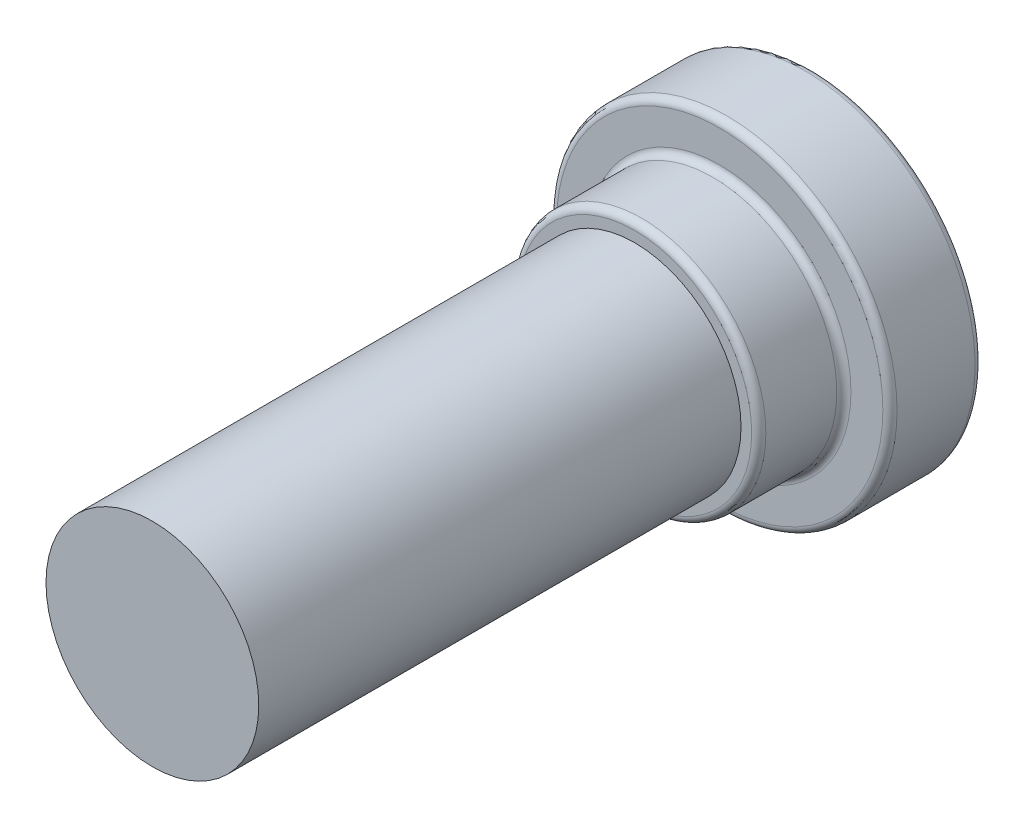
ISO-10303-21;
HEADER;
FILE_DESCRIPTION(('STEP AP214'),'2;1');
FILE_NAME('part.step','',(''),(''),'','','');
FILE_SCHEMA(('AUTOMOTIVE_DESIGN { 1 0 10303 214 1 1 1 1 }'));
ENDSEC;
DATA;
#1=APPLICATION_CONTEXT('core data for automotive mechanical design processes');
#2=APPLICATION_PROTOCOL_DEFINITION('international standard','automotive_design',2000,#1);
#3=PRODUCT_CONTEXT('',#1,'mechanical');
#4=PRODUCT('Part','Part','',(#3));
#5=PRODUCT_RELATED_PRODUCT_CATEGORY('part','',(#4));
#6=PRODUCT_DEFINITION_FORMATION('','',#4);
#7=PRODUCT_DEFINITION_CONTEXT('part definition',#1,'design');
#8=PRODUCT_DEFINITION('design','',#6,#7);
#9=PRODUCT_DEFINITION_SHAPE('','',#8);
#10=(LENGTH_UNIT() NAMED_UNIT(*) SI_UNIT(.MILLI.,.METRE.));
#11=(NAMED_UNIT(*) PLANE_ANGLE_UNIT() SI_UNIT($,.RADIAN.));
#12=(NAMED_UNIT(*) SI_UNIT($,.STERADIAN.) SOLID_ANGLE_UNIT());
#13=UNCERTAINTY_MEASURE_WITH_UNIT(LENGTH_MEASURE(1.E-05),#10,'distance_accuracy_value','');
#14=(GEOMETRIC_REPRESENTATION_CONTEXT(3) GLOBAL_UNCERTAINTY_ASSIGNED_CONTEXT((#13)) GLOBAL_UNIT_ASSIGNED_CONTEXT((#10,
#11,#12)) REPRESENTATION_CONTEXT('',''));
#15=CARTESIAN_POINT('',(0.,0.,0.));
#16=DIRECTION('',(0.,0.,1.));
#17=DIRECTION('',(1.,0.,0.));
#18=AXIS2_PLACEMENT_3D('',#15,#16,#17);
#19=CARTESIAN_POINT('',(0.,0.,1.5));
#20=DIRECTION('',(0.,0.,-1.));
#21=DIRECTION('',(-1.,0.,0.));
#22=AXIS2_PLACEMENT_3D('',#19,#20,#21);
#23=PLANE('',#22);
#24=DIRECTION('',(0.866025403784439,-0.5,0.));
#25=VECTOR('',#24,1.);
#26=CARTESIAN_POINT('',(0.,-1.15470053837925,1.5));
#27=LINE('',#26,#25);
#28=CARTESIAN_POINT('',(0.,-1.15470053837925,1.5));
#29=VERTEX_POINT('',#28);
#30=CARTESIAN_POINT('',(-1.,-0.577350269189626,1.5));
#31=VERTEX_POINT('',#30);
#32=EDGE_CURVE('E116',#29,#31,#27,.F.);
#33=ORIENTED_EDGE('',*,*,#32,.T.);
#34=DIRECTION('',(0.,-1.,0.));
#35=VECTOR('',#34,1.);
#36=CARTESIAN_POINT('',(-1.,-0.577350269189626,1.5));
#37=LINE('',#36,#35);
#38=CARTESIAN_POINT('',(-0.999999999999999,0.577350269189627,1.5));
#39=VERTEX_POINT('',#38);
#40=EDGE_CURVE('E260',#31,#39,#37,.F.);
#41=ORIENTED_EDGE('',*,*,#40,.T.);
#42=DIRECTION('',(-0.866025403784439,-0.5,0.));
#43=VECTOR('',#42,1.);
#44=CARTESIAN_POINT('',(-0.999999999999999,0.577350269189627,1.5));
#45=LINE('',#44,#43);
#46=CARTESIAN_POINT('',(0.,1.15470053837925,1.5));
#47=VERTEX_POINT('',#46);
#48=EDGE_CURVE('E255',#39,#47,#45,.F.);
#49=ORIENTED_EDGE('',*,*,#48,.T.);
#50=DIRECTION('',(-0.866025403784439,0.5,0.));
#51=VECTOR('',#50,1.);
#52=CARTESIAN_POINT('',(0.,1.15470053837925,1.5));
#53=LINE('',#52,#51);
#54=CARTESIAN_POINT('',(1.,0.577350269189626,1.5));
#55=VERTEX_POINT('',#54);
#56=EDGE_CURVE('E99',#47,#55,#53,.F.);
#57=ORIENTED_EDGE('',*,*,#56,.T.);
#58=DIRECTION('',(0.,1.,0.));
#59=VECTOR('',#58,1.);
#60=CARTESIAN_POINT('',(1.,0.577350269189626,1.5));
#61=LINE('',#60,#59);
#62=CARTESIAN_POINT('',(1.,-0.577350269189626,1.5));
#63=VERTEX_POINT('',#62);
#64=EDGE_CURVE('E96',#55,#63,#61,.F.);
#65=ORIENTED_EDGE('',*,*,#64,.T.);
#66=DIRECTION('',(0.866025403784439,0.5,0.));
#67=VECTOR('',#66,1.);
#68=CARTESIAN_POINT('',(1.,-0.577350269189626,1.5));
#69=LINE('',#68,#67);
#70=EDGE_CURVE('E93',#63,#29,#69,.F.);
#71=ORIENTED_EDGE('',*,*,#70,.T.);
#72=EDGE_LOOP('',(#33,#41,#49,#57,#65,#71));
#73=FACE_BOUND('',#72,.T.);
#74=ADVANCED_FACE('F17',(#73),#23,.T.);
#75=CARTESIAN_POINT('',(1.,0.577350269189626,1.5));
#76=DIRECTION('',(1.,0.,0.));
#77=DIRECTION('',(0.,1.,0.));
#78=AXIS2_PLACEMENT_3D('',#75,#76,#77);
#79=PLANE('',#78);
#80=DIRECTION('',(0.,0.,1.));
#81=VECTOR('',#80,1.);
#82=CARTESIAN_POINT('',(1.,-0.577350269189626,1.5));
#83=LINE('',#82,#81);
#84=CARTESIAN_POINT('',(1.,-0.577350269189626,0.));
#85=VERTEX_POINT('',#84);
#86=EDGE_CURVE('E102',#85,#63,#83,.T.);
#87=ORIENTED_EDGE('',*,*,#86,.T.);
#88=ORIENTED_EDGE('',*,*,#64,.F.);
#89=DIRECTION('',(0.,0.,1.));
#90=VECTOR('',#89,1.);
#91=CARTESIAN_POINT('',(1.,0.577350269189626,1.5));
#92=LINE('',#91,#90);
#93=CARTESIAN_POINT('',(1.,0.577350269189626,0.));
#94=VERTEX_POINT('',#93);
#95=EDGE_CURVE('E244',#55,#94,#92,.F.);
#96=ORIENTED_EDGE('',*,*,#95,.T.);
#97=DIRECTION('',(0.,1.,0.));
#98=VECTOR('',#97,1.);
#99=CARTESIAN_POINT('',(1.,0.,0.));
#100=LINE('',#99,#98);
#101=EDGE_CURVE('E107',#94,#85,#100,.F.);
#102=ORIENTED_EDGE('',*,*,#101,.T.);
#103=EDGE_LOOP('',(#87,#88,#96,#102));
#104=FACE_BOUND('',#103,.T.);
#105=ADVANCED_FACE('F105',(#104),#79,.F.);
#106=CARTESIAN_POINT('',(1.,-0.577350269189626,1.5));
#107=DIRECTION('',(0.5,-0.866025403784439,0.));
#108=DIRECTION('',(0.866025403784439,0.5,0.));
#109=AXIS2_PLACEMENT_3D('',#106,#107,#108);
#110=PLANE('',#109);
#111=DIRECTION('',(0.,0.,1.));
#112=VECTOR('',#111,1.);
#113=CARTESIAN_POINT('',(0.,-1.15470053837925,1.5));
#114=LINE('',#113,#112);
#115=CARTESIAN_POINT('',(0.,-1.15470053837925,0.));
#116=VERTEX_POINT('',#115);
#117=EDGE_CURVE('E113',#116,#29,#114,.T.);
#118=ORIENTED_EDGE('',*,*,#117,.T.);
#119=ORIENTED_EDGE('',*,*,#70,.F.);
#120=ORIENTED_EDGE('',*,*,#86,.F.);
#121=DIRECTION('',(-0.866025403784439,-0.5,0.));
#122=VECTOR('',#121,1.);
#123=CARTESIAN_POINT('',(1.,-0.577350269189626,0.));
#124=LINE('',#123,#122);
#125=EDGE_CURVE('E289',#85,#116,#124,.T.);
#126=ORIENTED_EDGE('',*,*,#125,.T.);
#127=EDGE_LOOP('',(#118,#119,#120,#126));
#128=FACE_BOUND('',#127,.T.);
#129=ADVANCED_FACE('F111',(#128),#110,.F.);
#130=CARTESIAN_POINT('',(0.,-1.15470053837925,1.5));
#131=DIRECTION('',(-0.5,-0.866025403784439,0.));
#132=DIRECTION('',(0.866025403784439,-0.5,0.));
#133=AXIS2_PLACEMENT_3D('',#130,#131,#132);
#134=PLANE('',#133);
#135=DIRECTION('',(0.,0.,1.));
#136=VECTOR('',#135,1.);
#137=CARTESIAN_POINT('',(-1.,-0.577350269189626,1.5));
#138=LINE('',#137,#136);
#139=CARTESIAN_POINT('',(-1.,-0.577350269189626,0.));
#140=VERTEX_POINT('',#139);
#141=EDGE_CURVE('E262',#140,#31,#138,.T.);
#142=ORIENTED_EDGE('',*,*,#141,.T.);
#143=ORIENTED_EDGE('',*,*,#32,.F.);
#144=ORIENTED_EDGE('',*,*,#117,.F.);
#145=DIRECTION('',(-0.866025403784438,0.5,0.));
#146=VECTOR('',#145,1.);
#147=CARTESIAN_POINT('',(0.,-1.15470053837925,0.));
#148=LINE('',#147,#146);
#149=EDGE_CURVE('E269',#116,#140,#148,.T.);
#150=ORIENTED_EDGE('',*,*,#149,.T.);
#151=EDGE_LOOP('',(#142,#143,#144,#150));
#152=FACE_BOUND('',#151,.T.);
#153=ADVANCED_FACE('F267',(#152),#134,.F.);
#154=CARTESIAN_POINT('',(-1.,-0.577350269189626,1.5));
#155=DIRECTION('',(-1.,0.,0.));
#156=DIRECTION('',(0.,-1.,0.));
#157=AXIS2_PLACEMENT_3D('',#154,#155,#156);
#158=PLANE('',#157);
#159=DIRECTION('',(0.,0.,1.));
#160=VECTOR('',#159,1.);
#161=CARTESIAN_POINT('',(-0.999999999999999,0.577350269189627,1.5));
#162=LINE('',#161,#160);
#163=CARTESIAN_POINT('',(-0.999999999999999,0.577350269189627,0.));
#164=VERTEX_POINT('',#163);
#165=EDGE_CURVE('E257',#164,#39,#162,.T.);
#166=ORIENTED_EDGE('',*,*,#165,.T.);
#167=ORIENTED_EDGE('',*,*,#40,.F.);
#168=ORIENTED_EDGE('',*,*,#141,.F.);
#169=DIRECTION('',(0.,1.,0.));
#170=VECTOR('',#169,1.);
#171=CARTESIAN_POINT('',(-1.,0.,0.));
#172=LINE('',#171,#170);
#173=EDGE_CURVE('E275',#140,#164,#172,.T.);
#174=ORIENTED_EDGE('',*,*,#173,.T.);
#175=EDGE_LOOP('',(#166,#167,#168,#174));
#176=FACE_BOUND('',#175,.T.);
#177=ADVANCED_FACE('F272',(#176),#158,.F.);
#178=CARTESIAN_POINT('',(-0.999999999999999,0.577350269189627,1.5));
#179=DIRECTION('',(-0.5,0.866025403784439,0.));
#180=DIRECTION('',(-0.866025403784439,-0.5,0.));
#181=AXIS2_PLACEMENT_3D('',#178,#179,#180);
#182=PLANE('',#181);
#183=DIRECTION('',(0.,0.,1.));
#184=VECTOR('',#183,1.);
#185=CARTESIAN_POINT('',(0.,1.15470053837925,1.5));
#186=LINE('',#185,#184);
#187=CARTESIAN_POINT('',(0.,1.15470053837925,0.));
#188=VERTEX_POINT('',#187);
#189=EDGE_CURVE('E252',#188,#47,#186,.T.);
#190=ORIENTED_EDGE('',*,*,#189,.T.);
#191=ORIENTED_EDGE('',*,*,#48,.F.);
#192=ORIENTED_EDGE('',*,*,#165,.F.);
#193=DIRECTION('',(0.866025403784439,0.5,0.));
#194=VECTOR('',#193,1.);
#195=CARTESIAN_POINT('',(-0.999999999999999,0.577350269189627,0.));
#196=LINE('',#195,#194);
#197=EDGE_CURVE('E280',#164,#188,#196,.T.);
#198=ORIENTED_EDGE('',*,*,#197,.T.);
#199=EDGE_LOOP('',(#190,#191,#192,#198));
#200=FACE_BOUND('',#199,.T.);
#201=ADVANCED_FACE('F278',(#200),#182,.F.);
#202=CARTESIAN_POINT('',(0.,1.15470053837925,1.5));
#203=DIRECTION('',(0.5,0.866025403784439,0.));
#204=DIRECTION('',(-0.866025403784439,0.5,0.));
#205=AXIS2_PLACEMENT_3D('',#202,#203,#204);
#206=PLANE('',#205);
#207=ORIENTED_EDGE('',*,*,#95,.F.);
#208=ORIENTED_EDGE('',*,*,#56,.F.);
#209=ORIENTED_EDGE('',*,*,#189,.F.);
#210=DIRECTION('',(0.866025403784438,-0.5,0.));
#211=VECTOR('',#210,1.);
#212=CARTESIAN_POINT('',(0.,1.15470053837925,0.));
#213=LINE('',#212,#211);
#214=EDGE_CURVE('E285',#188,#94,#213,.T.);
#215=ORIENTED_EDGE('',*,*,#214,.T.);
#216=EDGE_LOOP('',(#207,#208,#209,#215));
#217=FACE_BOUND('',#216,.T.);
#218=ADVANCED_FACE('F284',(#217),#206,.F.);
#219=CARTESIAN_POINT('',(0.,0.,0.));
#220=DIRECTION('',(0.,0.,1.));
#221=DIRECTION('',(1.,0.,0.));
#222=AXIS2_PLACEMENT_3D('',#219,#220,#221);
#223=PLANE('',#222);
#224=CARTESIAN_POINT('',(0.,0.,0.));
#225=DIRECTION('',(0.,0.,1.));
#226=DIRECTION('',(1.,0.,0.));
#227=AXIS2_PLACEMENT_3D('',#224,#225,#226);
#228=CIRCLE('',#227,2.3);
#229=CARTESIAN_POINT('',(2.3,0.,0.));
#230=VERTEX_POINT('',#229);
#231=CARTESIAN_POINT('',(-2.3,0.,0.));
#232=VERTEX_POINT('',#231);
#233=EDGE_CURVE('E287',#230,#232,#228,.T.);
#234=ORIENTED_EDGE('',*,*,#233,.F.);
#235=CARTESIAN_POINT('',(0.,0.,0.));
#236=DIRECTION('',(0.,0.,1.));
#237=DIRECTION('',(-1.,0.,0.));
#238=AXIS2_PLACEMENT_3D('',#235,#236,#237);
#239=CIRCLE('',#238,2.3);
#240=EDGE_CURVE('E306',#232,#230,#239,.T.);
#241=ORIENTED_EDGE('',*,*,#240,.F.);
#242=EDGE_LOOP('',(#234,#241));
#243=FACE_BOUND('',#242,.T.);
#244=ORIENTED_EDGE('',*,*,#197,.F.);
#245=ORIENTED_EDGE('',*,*,#173,.F.);
#246=ORIENTED_EDGE('',*,*,#149,.F.);
#247=ORIENTED_EDGE('',*,*,#125,.F.);
#248=ORIENTED_EDGE('',*,*,#101,.F.);
#249=ORIENTED_EDGE('',*,*,#214,.F.);
#250=EDGE_LOOP('',(#244,#245,#246,#247,#248,#249));
#251=FACE_BOUND('',#250,.T.);
#252=ADVANCED_FACE('F232',(#243,#251),#223,.F.);
#253=CARTESIAN_POINT('',(0.,0.,0.1));
#254=DIRECTION('',(0.,0.,1.));
#255=DIRECTION('',(1.,0.,0.));
#256=AXIS2_PLACEMENT_3D('',#253,#254,#255);
#257=TOROIDAL_SURFACE('',#256,2.3,0.1);
#258=ORIENTED_EDGE('',*,*,#233,.T.);
#259=ORIENTED_EDGE('',*,*,#240,.T.);
#260=EDGE_LOOP('',(#258,#259));
#261=FACE_BOUND('',#260,.T.);
#262=CARTESIAN_POINT('',(0.,0.,0.1));
#263=DIRECTION('',(0.,0.,-1.));
#264=DIRECTION('',(-1.,0.,0.));
#265=AXIS2_PLACEMENT_3D('',#262,#263,#264);
#266=CIRCLE('',#265,2.4);
#267=CARTESIAN_POINT('',(-2.4,0.,0.1));
#268=VERTEX_POINT('',#267);
#269=EDGE_CURVE('E224',#268,#268,#266,.F.);
#270=ORIENTED_EDGE('',*,*,#269,.F.);
#271=EDGE_LOOP('',(#270));
#272=FACE_BOUND('',#271,.T.);
#273=ADVANCED_FACE('F228',(#261,#272),#257,.T.);
#274=CARTESIAN_POINT('',(0.,0.,1.3));
#275=DIRECTION('',(0.,0.,-1.));
#276=DIRECTION('',(-1.,0.,0.));
#277=AXIS2_PLACEMENT_3D('',#274,#275,#276);
#278=CYLINDRICAL_SURFACE('',#277,2.4);
#279=CARTESIAN_POINT('',(0.,0.,1.2));
#280=DIRECTION('',(0.,0.,1.));
#281=DIRECTION('',(1.,0.,0.));
#282=AXIS2_PLACEMENT_3D('',#279,#280,#281);
#283=CIRCLE('',#282,2.4);
#284=CARTESIAN_POINT('',(2.4,0.,1.2));
#285=VERTEX_POINT('',#284);
#286=EDGE_CURVE('E216',#285,#285,#283,.T.);
#287=ORIENTED_EDGE('',*,*,#286,.F.);
#288=EDGE_LOOP('',(#287));
#289=FACE_BOUND('',#288,.T.);
#290=ORIENTED_EDGE('',*,*,#269,.T.);
#291=EDGE_LOOP('',(#290));
#292=FACE_BOUND('',#291,.T.);
#293=ADVANCED_FACE('F206',(#289,#292),#278,.T.);
#294=CARTESIAN_POINT('',(0.,0.,1.2));
#295=DIRECTION('',(0.,0.,1.));
#296=DIRECTION('',(1.,0.,0.));
#297=AXIS2_PLACEMENT_3D('',#294,#295,#296);
#298=TOROIDAL_SURFACE('',#297,2.3,0.1);
#299=ORIENTED_EDGE('',*,*,#286,.T.);
#300=EDGE_LOOP('',(#299));
#301=FACE_BOUND('',#300,.T.);
#302=CARTESIAN_POINT('',(0.,0.,1.3));
#303=DIRECTION('',(0.,0.,-1.));
#304=DIRECTION('',(1.,0.,0.));
#305=AXIS2_PLACEMENT_3D('',#302,#303,#304);
#306=CIRCLE('',#305,2.3);
#307=CARTESIAN_POINT('',(-2.3,0.,1.3));
#308=VERTEX_POINT('',#307);
#309=CARTESIAN_POINT('',(2.3,0.,1.3));
#310=VERTEX_POINT('',#309);
#311=EDGE_CURVE('E212',#308,#310,#306,.F.);
#312=ORIENTED_EDGE('',*,*,#311,.F.);
#313=CARTESIAN_POINT('',(0.,0.,1.3));
#314=DIRECTION('',(0.,0.,-1.));
#315=DIRECTION('',(-1.,0.,0.));
#316=AXIS2_PLACEMENT_3D('',#313,#314,#315);
#317=CIRCLE('',#316,2.3);
#318=EDGE_CURVE('E193',#310,#308,#317,.F.);
#319=ORIENTED_EDGE('',*,*,#318,.F.);
#320=EDGE_LOOP('',(#312,#319));
#321=FACE_BOUND('',#320,.T.);
#322=ADVANCED_FACE('F197',(#301,#321),#298,.T.);
#323=CARTESIAN_POINT('',(0.,0.,1.3));
#324=DIRECTION('',(0.,0.,1.));
#325=DIRECTION('',(1.,0.,0.));
#326=AXIS2_PLACEMENT_3D('',#323,#324,#325);
#327=PLANE('',#326);
#328=ORIENTED_EDGE('',*,*,#318,.T.);
#329=ORIENTED_EDGE('',*,*,#311,.T.);
#330=EDGE_LOOP('',(#328,#329));
#331=FACE_BOUND('',#330,.T.);
#332=CARTESIAN_POINT('',(0.,0.,1.3));
#333=DIRECTION('',(0.,0.,1.));
#334=DIRECTION('',(-1.,0.,0.));
#335=AXIS2_PLACEMENT_3D('',#332,#333,#334);
#336=CIRCLE('',#335,1.85);
#337=CARTESIAN_POINT('',(1.85,0.,1.3));
#338=VERTEX_POINT('',#337);
#339=CARTESIAN_POINT('',(-1.85,0.,1.3));
#340=VERTEX_POINT('',#339);
#341=EDGE_CURVE('E485',#338,#340,#336,.F.);
#342=ORIENTED_EDGE('',*,*,#341,.T.);
#343=CARTESIAN_POINT('',(0.,0.,1.3));
#344=DIRECTION('',(0.,0.,1.));
#345=DIRECTION('',(1.,0.,0.));
#346=AXIS2_PLACEMENT_3D('',#343,#344,#345);
#347=CIRCLE('',#346,1.85);
#348=EDGE_CURVE('E486',#340,#338,#347,.F.);
#349=ORIENTED_EDGE('',*,*,#348,.T.);
#350=EDGE_LOOP('',(#342,#349));
#351=FACE_BOUND('',#350,.T.);
#352=ADVANCED_FACE('F172',(#331,#351),#327,.T.);
#353=CARTESIAN_POINT('',(0.,0.,1.4));
#354=DIRECTION('',(0.,0.,1.));
#355=DIRECTION('',(1.,0.,0.));
#356=AXIS2_PLACEMENT_3D('',#353,#354,#355);
#357=TOROIDAL_SURFACE('',#356,1.85,0.1);
#358=ORIENTED_EDGE('',*,*,#341,.F.);
#359=ORIENTED_EDGE('',*,*,#348,.F.);
#360=EDGE_LOOP('',(#358,#359));
#361=FACE_BOUND('',#360,.T.);
#362=CARTESIAN_POINT('',(0.,0.,1.4));
#363=DIRECTION('',(0.,0.,-1.));
#364=DIRECTION('',(-1.,0.,0.));
#365=AXIS2_PLACEMENT_3D('',#362,#363,#364);
#366=CIRCLE('',#365,1.75);
#367=CARTESIAN_POINT('',(-1.75,0.,1.4));
#368=VERTEX_POINT('',#367);
#369=EDGE_CURVE('E164',#368,#368,#366,.F.);
#370=ORIENTED_EDGE('',*,*,#369,.F.);
#371=EDGE_LOOP('',(#370));
#372=FACE_BOUND('',#371,.T.);
#373=ADVANCED_FACE('F168',(#361,#372),#357,.F.);
#374=CARTESIAN_POINT('',(0.,0.,2.5));
#375=DIRECTION('',(0.,0.,-1.));
#376=DIRECTION('',(-1.,0.,0.));
#377=AXIS2_PLACEMENT_3D('',#374,#375,#376);
#378=CYLINDRICAL_SURFACE('',#377,1.75);
#379=CARTESIAN_POINT('',(0.,0.,2.4));
#380=DIRECTION('',(0.,0.,1.));
#381=DIRECTION('',(1.,0.,0.));
#382=AXIS2_PLACEMENT_3D('',#379,#380,#381);
#383=CIRCLE('',#382,1.75);
#384=CARTESIAN_POINT('',(1.75,0.,2.4));
#385=VERTEX_POINT('',#384);
#386=EDGE_CURVE('E156',#385,#385,#383,.T.);
#387=ORIENTED_EDGE('',*,*,#386,.F.);
#388=EDGE_LOOP('',(#387));
#389=FACE_BOUND('',#388,.T.);
#390=ORIENTED_EDGE('',*,*,#369,.T.);
#391=EDGE_LOOP('',(#390));
#392=FACE_BOUND('',#391,.T.);
#393=ADVANCED_FACE('F142',(#389,#392),#378,.T.);
#394=CARTESIAN_POINT('',(0.,0.,2.4));
#395=DIRECTION('',(0.,0.,1.));
#396=DIRECTION('',(1.,0.,0.));
#397=AXIS2_PLACEMENT_3D('',#394,#395,#396);
#398=TOROIDAL_SURFACE('',#397,1.65,0.1);
#399=ORIENTED_EDGE('',*,*,#386,.T.);
#400=EDGE_LOOP('',(#399));
#401=FACE_BOUND('',#400,.T.);
#402=CARTESIAN_POINT('',(0.,0.,2.5));
#403=DIRECTION('',(0.,0.,-1.));
#404=DIRECTION('',(1.,0.,0.));
#405=AXIS2_PLACEMENT_3D('',#402,#403,#404);
#406=CIRCLE('',#405,1.65);
#407=CARTESIAN_POINT('',(-1.65,0.,2.5));
#408=VERTEX_POINT('',#407);
#409=CARTESIAN_POINT('',(1.65,0.,2.5));
#410=VERTEX_POINT('',#409);
#411=EDGE_CURVE('E36',#408,#410,#406,.F.);
#412=ORIENTED_EDGE('',*,*,#411,.F.);
#413=CARTESIAN_POINT('',(0.,0.,2.5));
#414=DIRECTION('',(0.,0.,-1.));
#415=DIRECTION('',(-1.,0.,0.));
#416=AXIS2_PLACEMENT_3D('',#413,#414,#415);
#417=CIRCLE('',#416,1.65);
#418=EDGE_CURVE('E123',#410,#408,#417,.F.);
#419=ORIENTED_EDGE('',*,*,#418,.F.);
#420=EDGE_LOOP('',(#412,#419));
#421=FACE_BOUND('',#420,.T.);
#422=ADVANCED_FACE('F130',(#401,#421),#398,.T.);
#423=CARTESIAN_POINT('',(0.,0.,9.3));
#424=DIRECTION('',(0.,0.,1.));
#425=DIRECTION('',(1.,0.,0.));
#426=AXIS2_PLACEMENT_3D('',#423,#424,#425);
#427=PLANE('',#426);
#428=CARTESIAN_POINT('',(0.,0.,9.3));
#429=DIRECTION('',(0.,0.,-1.));
#430=DIRECTION('',(-1.,0.,0.));
#431=AXIS2_PLACEMENT_3D('',#428,#429,#430);
#432=CIRCLE('',#431,1.5);
#433=CARTESIAN_POINT('',(-1.5,0.,9.3));
#434=VERTEX_POINT('',#433);
#435=EDGE_CURVE('E28',#434,#434,#432,.T.);
#436=ORIENTED_EDGE('',*,*,#435,.F.);
#437=EDGE_LOOP('',(#436));
#438=FACE_BOUND('',#437,.T.);
#439=ADVANCED_FACE('F141',(#438),#427,.T.);
#440=CARTESIAN_POINT('',(0.,0.,2.5));
#441=DIRECTION('',(0.,0.,1.));
#442=DIRECTION('',(1.,0.,0.));
#443=AXIS2_PLACEMENT_3D('',#440,#441,#442);
#444=PLANE('',#443);
#445=CARTESIAN_POINT('',(0.,0.,2.5));
#446=DIRECTION('',(0.,0.,-1.));
#447=DIRECTION('',(-1.,0.,0.));
#448=AXIS2_PLACEMENT_3D('',#445,#446,#447);
#449=CIRCLE('',#448,1.5);
#450=CARTESIAN_POINT('',(-1.5,0.,2.5));
#451=VERTEX_POINT('',#450);
#452=EDGE_CURVE('E11',#451,#451,#449,.F.);
#453=ORIENTED_EDGE('',*,*,#452,.F.);
#454=EDGE_LOOP('',(#453));
#455=FACE_BOUND('',#454,.T.);
#456=ORIENTED_EDGE('',*,*,#418,.T.);
#457=ORIENTED_EDGE('',*,*,#411,.T.);
#458=EDGE_LOOP('',(#456,#457));
#459=FACE_BOUND('',#458,.T.);
#460=ADVANCED_FACE('F326',(#455,#459),#444,.T.);
#461=CARTESIAN_POINT('',(0.,0.,9.3));
#462=DIRECTION('',(0.,0.,-1.));
#463=DIRECTION('',(-1.,0.,0.));
#464=AXIS2_PLACEMENT_3D('',#461,#462,#463);
#465=CYLINDRICAL_SURFACE('',#464,1.5);
#466=ORIENTED_EDGE('',*,*,#452,.T.);
#467=EDGE_LOOP('',(#466));
#468=FACE_BOUND('',#467,.T.);
#469=ORIENTED_EDGE('',*,*,#435,.T.);
#470=EDGE_LOOP('',(#469));
#471=FACE_BOUND('',#470,.T.);
#472=ADVANCED_FACE('F324',(#468,#471),#465,.T.);
#473=CLOSED_SHELL('',(#74,#105,#129,#153,#177,#201,#218,#252,#273,#293,#322,#352,#373,#393,#422,
#439,#460,#472));
#474=MANIFOLD_SOLID_BREP('B1',#473);
#475=ADVANCED_BREP_SHAPE_REPRESENTATION('',(#18,#474),#14);
#476=SHAPE_DEFINITION_REPRESENTATION(#9,#475);
ENDSEC;
END-ISO-10303-21;
